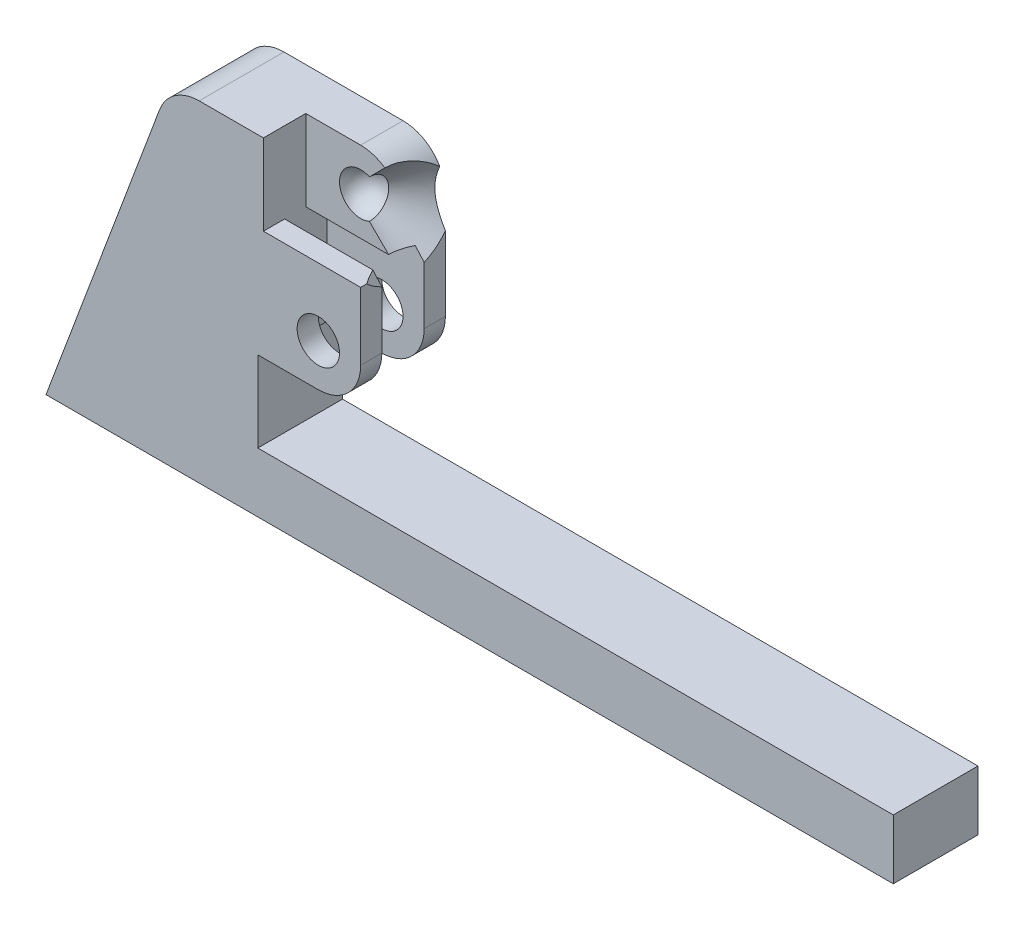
ISO-10303-21;
HEADER;
FILE_DESCRIPTION(('STEP AP214'),'2;1');
FILE_NAME('part.step','',(''),(''),'','','');
FILE_SCHEMA(('AUTOMOTIVE_DESIGN { 1 0 10303 214 1 1 1 1 }'));
ENDSEC;
DATA;
#1=APPLICATION_CONTEXT('core data for automotive mechanical design processes');
#2=APPLICATION_PROTOCOL_DEFINITION('international standard','automotive_design',2000,#1);
#3=PRODUCT_CONTEXT('',#1,'mechanical');
#4=PRODUCT('Part','Part','',(#3));
#5=PRODUCT_RELATED_PRODUCT_CATEGORY('part','',(#4));
#6=PRODUCT_DEFINITION_FORMATION('','',#4);
#7=PRODUCT_DEFINITION_CONTEXT('part definition',#1,'design');
#8=PRODUCT_DEFINITION('design','',#6,#7);
#9=PRODUCT_DEFINITION_SHAPE('','',#8);
#10=(LENGTH_UNIT() NAMED_UNIT(*) SI_UNIT(.MILLI.,.METRE.));
#11=(NAMED_UNIT(*) PLANE_ANGLE_UNIT() SI_UNIT($,.RADIAN.));
#12=(NAMED_UNIT(*) SI_UNIT($,.STERADIAN.) SOLID_ANGLE_UNIT());
#13=UNCERTAINTY_MEASURE_WITH_UNIT(LENGTH_MEASURE(1.E-05),#10,'distance_accuracy_value','');
#14=(GEOMETRIC_REPRESENTATION_CONTEXT(3) GLOBAL_UNCERTAINTY_ASSIGNED_CONTEXT((#13)) GLOBAL_UNIT_ASSIGNED_CONTEXT((#10,
#11,#12)) REPRESENTATION_CONTEXT('',''));
#15=CARTESIAN_POINT('',(0.,0.,0.));
#16=DIRECTION('',(0.,0.,1.));
#17=DIRECTION('',(1.,0.,0.));
#18=AXIS2_PLACEMENT_3D('',#15,#16,#17);
#19=CARTESIAN_POINT('',(10.,25.,10.));
#20=DIRECTION('',(-1.,0.,0.));
#21=DIRECTION('',(0.,-1.,0.));
#22=AXIS2_PLACEMENT_3D('',#19,#20,#21);
#23=PLANE('',#22);
#24=CARTESIAN_POINT('',(10.,25.,0.));
#25=DIRECTION('',(-1.,0.,0.));
#26=DIRECTION('',(0.,-1.,0.));
#27=AXIS2_PLACEMENT_3D('',#24,#25,#26);
#28=CIRCLE('',#27,12.496088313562);
#29=CARTESIAN_POINT('',(10.,13.5478288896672,-5.));
#30=VERTEX_POINT('',#29);
#31=CARTESIAN_POINT('',(10.,17.5065212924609,-10.));
#32=VERTEX_POINT('',#31);
#33=EDGE_CURVE('E239',#30,#32,#28,.F.);
#34=ORIENTED_EDGE('',*,*,#33,.F.);
#35=DIRECTION('',(0.,-1.,0.));
#36=VECTOR('',#35,1.);
#37=CARTESIAN_POINT('',(10.,25.,-5.));
#38=LINE('',#37,#36);
#39=CARTESIAN_POINT('',(10.,0.,-5.));
#40=VERTEX_POINT('',#39);
#41=EDGE_CURVE('E419',#30,#40,#38,.T.);
#42=ORIENTED_EDGE('',*,*,#41,.T.);
#43=DIRECTION('',(0.,0.,-1.));
#44=VECTOR('',#43,1.);
#45=CARTESIAN_POINT('',(10.,0.,10.));
#46=LINE('',#45,#44);
#47=CARTESIAN_POINT('',(10.,0.,-10.));
#48=VERTEX_POINT('',#47);
#49=EDGE_CURVE('E322',#40,#48,#46,.T.);
#50=ORIENTED_EDGE('',*,*,#49,.T.);
#51=DIRECTION('',(0.,1.,0.));
#52=VECTOR('',#51,1.);
#53=CARTESIAN_POINT('',(10.,25.,-10.));
#54=LINE('',#53,#52);
#55=EDGE_CURVE('E386',#48,#32,#54,.T.);
#56=ORIENTED_EDGE('',*,*,#55,.T.);
#57=EDGE_LOOP('',(#34,#42,#50,#56));
#58=FACE_BOUND('',#57,.T.);
#59=ADVANCED_FACE('F33',(#58),#23,.F.);
#60=CARTESIAN_POINT('',(0.,0.,10.));
#61=DIRECTION('',(0.,0.,-1.));
#62=DIRECTION('',(-1.,0.,0.));
#63=AXIS2_PLACEMENT_3D('',#60,#61,#62);
#64=CYLINDRICAL_SURFACE('',#63,10.);
#65=ORIENTED_EDGE('',*,*,#49,.F.);
#66=CARTESIAN_POINT('',(0.,0.,-5.));
#67=DIRECTION('',(0.,0.,-1.));
#68=DIRECTION('',(-1.,0.,0.));
#69=AXIS2_PLACEMENT_3D('',#66,#67,#68);
#70=CIRCLE('',#69,10.);
#71=CARTESIAN_POINT('',(0.,-10.,-5.));
#72=VERTEX_POINT('',#71);
#73=EDGE_CURVE('E460',#40,#72,#70,.T.);
#74=ORIENTED_EDGE('',*,*,#73,.T.);
#75=DIRECTION('',(0.,0.,-1.));
#76=VECTOR('',#75,1.);
#77=CARTESIAN_POINT('',(0.,-10.,10.));
#78=LINE('',#77,#76);
#79=CARTESIAN_POINT('',(0.,-10.,-10.));
#80=VERTEX_POINT('',#79);
#81=EDGE_CURVE('E321',#72,#80,#78,.T.);
#82=ORIENTED_EDGE('',*,*,#81,.T.);
#83=CARTESIAN_POINT('',(0.,0.,-10.));
#84=DIRECTION('',(0.,0.,1.));
#85=DIRECTION('',(1.,0.,0.));
#86=AXIS2_PLACEMENT_3D('',#83,#84,#85);
#87=CIRCLE('',#86,10.);
#88=EDGE_CURVE('E383',#80,#48,#87,.T.);
#89=ORIENTED_EDGE('',*,*,#88,.T.);
#90=EDGE_LOOP('',(#65,#74,#82,#89));
#91=FACE_BOUND('',#90,.T.);
#92=ADVANCED_FACE('F296',(#91),#64,.T.);
#93=CARTESIAN_POINT('',(0.,0.,10.));
#94=DIRECTION('',(0.,0.,-1.));
#95=DIRECTION('',(-1.,0.,0.));
#96=AXIS2_PLACEMENT_3D('',#93,#94,#95);
#97=CYLINDRICAL_SURFACE('',#96,5.);
#98=CARTESIAN_POINT('',(0.,0.,-5.));
#99=DIRECTION('',(0.,0.,-1.));
#100=DIRECTION('',(-1.,0.,0.));
#101=AXIS2_PLACEMENT_3D('',#98,#99,#100);
#102=CIRCLE('',#101,5.);
#103=CARTESIAN_POINT('',(-5.,0.,-5.));
#104=VERTEX_POINT('',#103);
#105=EDGE_CURVE('E455',#104,#104,#102,.T.);
#106=ORIENTED_EDGE('',*,*,#105,.F.);
#107=EDGE_LOOP('',(#106));
#108=FACE_BOUND('',#107,.T.);
#109=CARTESIAN_POINT('',(0.,0.,-10.));
#110=DIRECTION('',(0.,0.,1.));
#111=DIRECTION('',(1.,0.,0.));
#112=AXIS2_PLACEMENT_3D('',#109,#110,#111);
#113=CIRCLE('',#112,5.);
#114=CARTESIAN_POINT('',(5.,0.,-10.));
#115=VERTEX_POINT('',#114);
#116=EDGE_CURVE('E370',#115,#115,#113,.T.);
#117=ORIENTED_EDGE('',*,*,#116,.F.);
#118=EDGE_LOOP('',(#117));
#119=FACE_BOUND('',#118,.T.);
#120=ADVANCED_FACE('F301',(#108,#119),#97,.F.);
#121=CARTESIAN_POINT('',(11.5530314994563,25.,0.));
#122=DIRECTION('',(1.,0.,0.));
#123=DIRECTION('',(0.,0.,-1.));
#124=AXIS2_PLACEMENT_3D('',#121,#122,#123);
#125=CONICAL_SURFACE('',#124,14.0515140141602,0.786168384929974);
#126=DIRECTION('',(-0.706561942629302,0.707651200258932,0.));
#127=VECTOR('',#126,1.);
#128=CARTESIAN_POINT('',(-2.47685361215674,25.,0.));
#129=LINE('',#128,#127);
#130=CARTESIAN_POINT('',(6.58274264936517,15.9264371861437,0.));
#131=VERTEX_POINT('',#130);
#132=CARTESIAN_POINT('',(2.06829768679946,20.4478417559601,0.));
#133=VERTEX_POINT('',#132);
#134=EDGE_CURVE('E53',#131,#133,#129,.T.);
#135=ORIENTED_EDGE('',*,*,#134,.F.);
#136=CARTESIAN_POINT('',(16.1614168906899,15.9264371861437,-16.3134144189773));
#137=CARTESIAN_POINT('',(15.8812075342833,15.9264371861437,-15.9922520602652));
#138=CARTESIAN_POINT('',(15.6020744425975,15.9264371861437,-15.6701440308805));
#139=CARTESIAN_POINT('',(15.0464163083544,15.9264371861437,-15.0236571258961));
#140=CARTESIAN_POINT('',(14.7698914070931,15.9264371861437,-14.6992781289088));
#141=CARTESIAN_POINT('',(14.2194580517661,15.9264371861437,-14.0473388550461));
#142=CARTESIAN_POINT('',(13.9455549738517,15.9264371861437,-13.7197740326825));
#143=CARTESIAN_POINT('',(13.4014895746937,15.9264371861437,-13.0615583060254));
#144=CARTESIAN_POINT('',(13.1313271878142,15.9264371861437,-12.7309074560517));
#145=CARTESIAN_POINT('',(12.5859261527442,15.9264371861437,-12.0540151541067));
#146=CARTESIAN_POINT('',(12.3108531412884,15.9264371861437,-11.7076399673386));
#147=CARTESIAN_POINT('',(11.766748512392,15.9264371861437,-11.0101802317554));
#148=CARTESIAN_POINT('',(11.4977167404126,15.9264371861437,-10.6590958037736));
#149=CARTESIAN_POINT('',(10.9674257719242,15.9264371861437,-9.9514576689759));
#150=CARTESIAN_POINT('',(10.7061613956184,15.9264371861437,-9.59490785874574));
#151=CARTESIAN_POINT('',(10.1933677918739,15.9264371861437,-8.87490734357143));
#152=CARTESIAN_POINT('',(9.94183763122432,15.9264371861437,-8.5114573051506));
#153=CARTESIAN_POINT('',(9.43759082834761,15.9264371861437,-7.75539837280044));
#154=CARTESIAN_POINT('',(9.18560199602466,15.9264371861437,-7.36229870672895));
#155=CARTESIAN_POINT('',(8.82183818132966,15.9264371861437,-6.76385457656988));
#156=CARTESIAN_POINT('',(8.70292087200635,15.9264371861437,-6.56284751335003));
#157=CARTESIAN_POINT('',(8.47068500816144,15.9264371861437,-6.15763206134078));
#158=CARTESIAN_POINT('',(8.35736610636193,15.9264371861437,-5.95342387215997));
#159=CARTESIAN_POINT('',(8.13824172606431,15.9264371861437,-5.54329607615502));
#160=CARTESIAN_POINT('',(8.03237895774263,15.9264371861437,-5.33740729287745));
#161=CARTESIAN_POINT('',(7.82821845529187,15.9264371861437,-4.92192583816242));
#162=CARTESIAN_POINT('',(7.72992122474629,15.9264371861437,-4.71233292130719));
#163=CARTESIAN_POINT('',(7.44847549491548,15.9264371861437,-4.07799518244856));
#164=CARTESIAN_POINT('',(7.2784665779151,15.9264371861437,-3.64713217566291));
#165=CARTESIAN_POINT('',(7.0751310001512,15.9264371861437,-3.03623306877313));
#166=CARTESIAN_POINT('',(7.02151511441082,15.9264371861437,-2.86284164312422));
#167=CARTESIAN_POINT('',(6.92249141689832,15.9264371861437,-2.51371588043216));
#168=CARTESIAN_POINT('',(6.87708315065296,15.9264371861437,-2.33798167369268));
#169=CARTESIAN_POINT('',(6.79526403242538,15.9264371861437,-1.98431336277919));
#170=CARTESIAN_POINT('',(6.75885841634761,15.9264371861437,-1.80637804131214));
#171=CARTESIAN_POINT('',(6.69581922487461,15.9264371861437,-1.44878567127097));
#172=CARTESIAN_POINT('',(6.66918529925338,15.9264371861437,-1.26912868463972));
#173=CARTESIAN_POINT('',(6.62100820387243,15.9264371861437,-0.864106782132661));
#174=CARTESIAN_POINT('',(6.6023382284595,15.9264371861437,-0.63839119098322));
#175=CARTESIAN_POINT('',(6.58184261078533,15.9264371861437,-0.186191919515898));
#176=CARTESIAN_POINT('',(6.58001730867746,15.9264371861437,0.0402917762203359));
#177=CARTESIAN_POINT('',(6.59327695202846,15.9264371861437,0.492548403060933));
#178=CARTESIAN_POINT('',(6.60834583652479,15.9264371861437,0.718321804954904));
#179=CARTESIAN_POINT('',(6.65478204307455,15.9264371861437,1.16818056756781));
#180=CARTESIAN_POINT('',(6.68615139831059,15.9264371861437,1.39226571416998));
#181=CARTESIAN_POINT('',(6.78521292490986,15.9264371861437,1.95834294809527));
#182=CARTESIAN_POINT('',(6.86337475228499,15.9264371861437,2.29852534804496));
#183=CARTESIAN_POINT('',(7.05036960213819,15.9264371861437,2.97034442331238));
#184=CARTESIAN_POINT('',(7.15922191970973,15.9264371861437,3.30197557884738));
#185=CARTESIAN_POINT('',(7.40326135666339,15.9264371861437,3.96017307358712));
#186=CARTESIAN_POINT('',(7.53877022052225,15.9264371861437,4.28661880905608));
#187=CARTESIAN_POINT('',(7.75702230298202,15.9264371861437,4.76931671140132));
#188=CARTESIAN_POINT('',(7.83226197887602,15.9264371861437,4.92903695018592));
#189=CARTESIAN_POINT('',(7.98719131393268,15.9264371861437,5.2463036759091));
#190=CARTESIAN_POINT('',(8.06688087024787,15.9264371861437,5.4038502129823));
#191=CARTESIAN_POINT('',(8.29843282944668,15.9264371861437,5.84770147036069));
#192=CARTESIAN_POINT('',(8.45495448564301,15.9264371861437,6.13157790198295));
#193=CARTESIAN_POINT('',(8.77861301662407,15.9264371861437,6.69324078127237));
#194=CARTESIAN_POINT('',(8.94575210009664,15.9264371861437,6.97102594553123));
#195=CARTESIAN_POINT('',(9.28871574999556,15.9264371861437,7.52146921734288));
#196=CARTESIAN_POINT('',(9.46454711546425,15.9264371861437,7.79412307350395));
#197=CARTESIAN_POINT('',(9.8231623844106,15.9264371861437,8.33477583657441));
#198=CARTESIAN_POINT('',(10.0059458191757,15.9264371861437,8.60277505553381));
#199=CARTESIAN_POINT('',(10.3780210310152,15.9264371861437,9.13589829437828));
#200=CARTESIAN_POINT('',(10.5673371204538,15.9264371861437,9.40100530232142));
#201=CARTESIAN_POINT('',(10.9507534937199,15.9264371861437,9.92773474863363));
#202=CARTESIAN_POINT('',(11.1448538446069,15.9264371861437,10.1893571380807));
#203=CARTESIAN_POINT('',(11.5369699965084,15.9264371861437,10.7094701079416));
#204=CARTESIAN_POINT('',(11.7349840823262,15.9264371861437,10.9679619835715));
#205=CARTESIAN_POINT('',(12.134391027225,15.9264371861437,11.4823244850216));
#206=CARTESIAN_POINT('',(12.3357839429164,15.9264371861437,11.7381950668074));
#207=CARTESIAN_POINT('',(12.9084777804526,15.9264371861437,12.457449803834));
#208=CARTESIAN_POINT('',(13.2831084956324,15.9264371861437,12.9181831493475));
#209=CARTESIAN_POINT('',(14.0396182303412,15.9264371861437,13.8337240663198));
#210=CARTESIAN_POINT('',(14.4214980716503,15.9264371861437,14.2885309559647));
#211=CARTESIAN_POINT('',(15.1872783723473,15.9264371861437,15.1891404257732));
#212=CARTESIAN_POINT('',(15.5711266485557,15.9264371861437,15.6349874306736));
#213=CARTESIAN_POINT('',(16.15014130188,15.9264371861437,16.3008543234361));
#214=CARTESIAN_POINT('',(16.343667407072,15.9264371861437,16.5223044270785));
#215=CARTESIAN_POINT('',(16.7317045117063,15.9264371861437,16.9643373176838));
#216=CARTESIAN_POINT('',(16.9262155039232,15.9264371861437,17.1849201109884));
#217=CARTESIAN_POINT('',(17.1211663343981,15.9264371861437,17.4051137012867));
#218=B_SPLINE_CURVE_WITH_KNOTS('',3,(#136,#137,#138,#139,#140,#141,#142,#143,#144,#145,#146,
#147,#148,#149,#150,#151,#152,#153,#154,#155,#156,#157,#158,#159,#160,#161,#162,#163,#164,#165,
#166,#167,#168,#169,#170,#171,#172,#173,#174,#175,#176,#177,#178,#179,#180,#181,#182,#183,#184,
#185,#186,#187,#188,#189,#190,#191,#192,#193,#194,#195,#196,#197,#198,#199,#200,#201,#202,#203,
#204,#205,#206,#207,#208,#209,#210,#211,#212,#213,#214,#215,#216,#217),.UNSPECIFIED.,.F.,.F.,(4,
2,2,2,2,2,2,2,2,2,2,2,2,2,2,2,2,2,2,2,2,2,2,2,2,2,2,2,2,2,2,2,2,2,2,2,2,2,2,2,4),(0.,
1.27866171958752,2.55739231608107,3.83834301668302,5.11927121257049,6.44615668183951,
7.77300816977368,9.09895402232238,10.4247724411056,11.8251041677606,12.5256788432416,
13.2262100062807,13.9205832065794,14.6150025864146,16.001932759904,16.5462553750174,
17.0905478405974,17.6351561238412,18.1797448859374,18.8585743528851,19.5374175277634,
20.2156158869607,20.893898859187,21.9391975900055,22.9851549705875,24.04461141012,
24.5742225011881,25.1038213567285,26.0760133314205,27.0484082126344,28.0215761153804,
28.994678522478,29.971907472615,30.9491501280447,31.925973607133,32.9028134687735,
34.684167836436,36.4657253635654,38.2306437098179,39.1129297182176,39.9952092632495),.UNSPECIFIED.);
#219=CARTESIAN_POINT('',(7.86719688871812,15.9264371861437,-5.));
#220=VERTEX_POINT('',#219);
#221=EDGE_CURVE('E476',#131,#220,#218,.F.);
#222=ORIENTED_EDGE('',*,*,#221,.T.);
#223=CARTESIAN_POINT('',(17.5868270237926,5.5373843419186,-5.));
#224=CARTESIAN_POINT('',(17.2104439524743,5.92660257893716,-5.));
#225=CARTESIAN_POINT('',(16.8344082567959,6.31615750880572,-5.));
#226=CARTESIAN_POINT('',(16.0832041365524,7.09610703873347,-5.));
#227=CARTESIAN_POINT('',(15.7080357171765,7.48650164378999,-5.));
#228=CARTESIAN_POINT('',(14.9586793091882,8.26835879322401,-5.));
#229=CARTESIAN_POINT('',(14.5844914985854,8.65982150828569,-5.));
#230=CARTESIAN_POINT('',(13.8374031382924,9.44397202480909,-5.));
#231=CARTESIAN_POINT('',(13.4645025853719,9.83665982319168,-5.));
#232=CARTESIAN_POINT('',(12.7170873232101,10.6269563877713,-5.));
#233=CARTESIAN_POINT('',(12.3425865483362,11.0245783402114,-5.));
#234=CARTESIAN_POINT('',(11.5956627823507,11.821768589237,-5.));
#235=CARTESIAN_POINT('',(11.2232397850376,12.2213368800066,-5.));
#236=CARTESIAN_POINT('',(10.4811111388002,13.022959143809,-5.));
#237=CARTESIAN_POINT('',(10.1114053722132,13.4250130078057,-5.));
#238=CARTESIAN_POINT('',(9.37559327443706,14.232397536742,-5.));
#239=CARTESIAN_POINT('',(9.00948688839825,14.6377281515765,-5.));
#240=CARTESIAN_POINT('',(8.38466726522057,15.338019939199,-5.));
#241=CARTESIAN_POINT('',(8.12475280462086,15.6319082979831,-5.));
#242=CARTESIAN_POINT('',(7.60824590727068,16.2225614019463,-5.));
#243=CARTESIAN_POINT('',(7.35165325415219,16.5193259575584,-5.));
#244=CARTESIAN_POINT('',(6.84349515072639,17.115769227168,-5.));
#245=CARTESIAN_POINT('',(6.59191808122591,17.4154380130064,-5.));
#246=CARTESIAN_POINT('',(6.09454980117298,18.0196742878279,-5.));
#247=CARTESIAN_POINT('',(5.84875998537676,18.3242429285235,-5.));
#248=CARTESIAN_POINT('',(5.37964555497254,18.9215854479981,-5.));
#249=CARTESIAN_POINT('',(5.15585279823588,19.2139887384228,-5.));
#250=CARTESIAN_POINT('',(4.82795407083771,19.6582104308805,-5.));
#251=CARTESIAN_POINT('',(4.71998368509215,19.8071755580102,-5.));
#252=CARTESIAN_POINT('',(4.50717212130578,20.1073205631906,-5.));
#253=CARTESIAN_POINT('',(4.4023307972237,20.2585003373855,-5.));
#254=CARTESIAN_POINT('',(4.19599288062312,20.5641229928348,-5.));
#255=CARTESIAN_POINT('',(4.09451340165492,20.7185774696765,-5.));
#256=CARTESIAN_POINT('',(3.89631678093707,21.0304782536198,-5.));
#257=CARTESIAN_POINT('',(3.79959866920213,21.1879239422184,-5.));
#258=CARTESIAN_POINT('',(3.61184996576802,21.5066763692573,-5.));
#259=CARTESIAN_POINT('',(3.52083261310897,21.6679909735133,-5.));
#260=CARTESIAN_POINT('',(3.38987806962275,21.9130114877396,-5.));
#261=CARTESIAN_POINT('',(3.34714066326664,21.9952234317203,-5.));
#262=CARTESIAN_POINT('',(3.26376733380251,22.1607198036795,-5.));
#263=CARTESIAN_POINT('',(3.22313171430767,22.2440043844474,-5.));
#264=CARTESIAN_POINT('',(3.1836687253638,22.3278507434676,-5.));
#265=B_SPLINE_CURVE_WITH_KNOTS('',3,(#223,#224,#225,#226,#227,#228,#229,#230,#231,#232,#233,
#234,#235,#236,#237,#238,#239,#240,#241,#242,#243,#244,#245,#246,#247,#248,#249,#250,#251,#252,
#253,#254,#255,#256,#257,#258,#259,#260,#261,#262,#263,#264),.UNSPECIFIED.,.F.,.F.,(4,2,2,2,2,2,
2,2,2,2,2,2,2,2,2,2,2,2,2,2,4),(0.,1.62431446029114,3.24863861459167,4.87323962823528,
6.49783656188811,8.13648473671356,9.77512801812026,11.4136999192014,13.0522468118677,
14.2292300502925,15.4061362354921,16.5798917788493,17.7539273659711,18.8583906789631,
19.4102959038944,19.9621753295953,20.5165303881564,21.070772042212,21.6262564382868,
21.904200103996,22.1821838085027),.UNSPECIFIED.);
#266=EDGE_CURVE('E11',#30,#220,#265,.T.);
#267=ORIENTED_EDGE('',*,*,#266,.F.);
#268=ORIENTED_EDGE('',*,*,#33,.T.);
#269=CARTESIAN_POINT('',(21.6240766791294,3.03076813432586,-10.));
#270=CARTESIAN_POINT('',(21.1931727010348,3.50499275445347,-10.));
#271=CARTESIAN_POINT('',(20.7635280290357,3.98036867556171,-10.));
#272=CARTESIAN_POINT('',(19.9073895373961,4.93399549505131,-10.));
#273=CARTESIAN_POINT('',(19.4808958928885,5.41224655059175,-10.));
#274=CARTESIAN_POINT('',(18.6306695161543,6.37335320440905,-10.));
#275=CARTESIAN_POINT('',(18.2069464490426,6.85621736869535,-10.));
#276=CARTESIAN_POINT('',(17.5749596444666,7.58362501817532,-10.));
#277=CARTESIAN_POINT('',(17.3649002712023,7.82660897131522,-10.));
#278=CARTESIAN_POINT('',(16.9461212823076,8.31373785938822,-10.));
#279=CARTESIAN_POINT('',(16.7374016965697,8.55788282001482,-10.));
#280=CARTESIAN_POINT('',(16.0694206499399,9.34411392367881,-10.));
#281=CARTESIAN_POINT('',(15.6130814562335,9.88869063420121,-10.));
#282=CARTESIAN_POINT('',(14.7100564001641,10.9857923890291,-10.));
#283=CARTESIAN_POINT('',(14.2633701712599,11.5383171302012,-10.));
#284=CARTESIAN_POINT('',(13.6034123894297,12.374559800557,-10.));
#285=CARTESIAN_POINT('',(13.3852209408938,12.6543957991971,-10.));
#286=CARTESIAN_POINT('',(12.9527058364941,13.2170379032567,-10.));
#287=CARTESIAN_POINT('',(12.7383821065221,13.4998439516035,-10.));
#288=CARTESIAN_POINT('',(12.3143415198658,14.0688351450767,-10.));
#289=CARTESIAN_POINT('',(12.1046240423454,14.3550198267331,-10.));
#290=CARTESIAN_POINT('',(11.6906746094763,14.9313219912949,-10.));
#291=CARTESIAN_POINT('',(11.4864424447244,15.2214393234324,-10.));
#292=CARTESIAN_POINT('',(11.0890564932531,15.7997386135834,-10.));
#293=CARTESIAN_POINT('',(10.8957574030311,16.0878204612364,-10.));
#294=CARTESIAN_POINT('',(10.5168348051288,16.6690120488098,-10.));
#295=CARTESIAN_POINT('',(10.3312114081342,16.9621218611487,-10.));
#296=CARTESIAN_POINT('',(9.96912595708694,17.5545101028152,-10.));
#297=CARTESIAN_POINT('',(9.79267648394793,17.8537962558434,-10.));
#298=CARTESIAN_POINT('',(9.45142194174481,18.4589635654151,-10.));
#299=CARTESIAN_POINT('',(9.28661656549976,18.7648445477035,-10.));
#300=CARTESIAN_POINT('',(8.97565902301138,19.3757704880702,-10.));
#301=CARTESIAN_POINT('',(8.82912698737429,19.6806207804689,-10.));
#302=CARTESIAN_POINT('',(8.55297771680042,20.2980078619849,-10.));
#303=CARTESIAN_POINT('',(8.4233627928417,20.6105456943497,-10.));
#304=CARTESIAN_POINT('',(8.18526896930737,21.2427320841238,-10.));
#305=CARTESIAN_POINT('',(8.07673599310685,21.5623600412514,-10.));
#306=CARTESIAN_POINT('',(7.88477760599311,22.208975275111,-10.));
#307=CARTESIAN_POINT('',(7.80133758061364,22.5359581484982,-10.));
#308=CARTESIAN_POINT('',(7.66521278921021,23.1892739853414,-10.));
#309=CARTESIAN_POINT('',(7.61192507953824,23.5154793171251,-10.));
#310=CARTESIAN_POINT('',(7.5366818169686,24.1715250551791,-10.));
#311=CARTESIAN_POINT('',(7.51472362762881,24.5013651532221,-10.));
#312=CARTESIAN_POINT('',(7.50362415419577,25.1613073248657,-10.));
#313=CARTESIAN_POINT('',(7.51445273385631,25.4914088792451,-10.));
#314=CARTESIAN_POINT('',(7.56811227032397,26.1489999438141,-10.));
#315=CARTESIAN_POINT('',(7.61094928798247,26.4764889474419,-10.));
#316=CARTESIAN_POINT('',(7.7380476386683,27.1945055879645,-10.));
#317=CARTESIAN_POINT('',(7.82912273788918,27.5838170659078,-10.));
#318=CARTESIAN_POINT('',(8.04736221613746,28.3521542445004,-10.));
#319=CARTESIAN_POINT('',(8.1745425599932,28.7311753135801,-10.));
#320=CARTESIAN_POINT('',(8.38809747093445,29.2944439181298,-10.));
#321=CARTESIAN_POINT('',(8.46380006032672,29.4828515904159,-10.));
#322=CARTESIAN_POINT('',(8.62181794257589,29.8568833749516,-10.));
#323=CARTESIAN_POINT('',(8.70413329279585,30.0425074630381,-10.));
#324=CARTESIAN_POINT('',(8.87455925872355,30.4109917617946,-10.));
#325=CARTESIAN_POINT('',(8.96266802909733,30.5938528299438,-10.));
#326=CARTESIAN_POINT('',(9.14400980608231,30.9570018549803,-10.));
#327=CARTESIAN_POINT('',(9.23724267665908,31.1372898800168,-10.));
#328=CARTESIAN_POINT('',(9.51022954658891,31.6492761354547,-10.));
#329=CARTESIAN_POINT('',(9.69552099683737,31.9780273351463,-10.));
#330=CARTESIAN_POINT('',(10.0784459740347,32.628293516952,-10.));
#331=CARTESIAN_POINT('',(10.2760822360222,32.9498068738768,-10.));
#332=CARTESIAN_POINT('',(10.681366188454,33.5868084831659,-10.));
#333=CARTESIAN_POINT('',(10.889021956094,33.9022915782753,-10.));
#334=CARTESIAN_POINT('',(11.3122727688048,34.5278321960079,-10.));
#335=CARTESIAN_POINT('',(11.527867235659,34.837890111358,-10.));
#336=CARTESIAN_POINT('',(11.9664653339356,35.4546737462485,-10.));
#337=CARTESIAN_POINT('',(12.1894963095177,35.7613799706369,-10.));
#338=CARTESIAN_POINT('',(12.6409519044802,36.3707950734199,-10.));
#339=CARTESIAN_POINT('',(12.8693766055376,36.6735038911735,-10.));
#340=CARTESIAN_POINT('',(13.3306083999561,37.2753439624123,-10.));
#341=CARTESIAN_POINT('',(13.563413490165,37.5744767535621,-10.));
#342=CARTESIAN_POINT('',(14.0327956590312,38.1697707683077,-10.));
#343=CARTESIAN_POINT('',(14.2693727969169,38.4659319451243,-10.));
#344=CARTESIAN_POINT('',(14.9329632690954,39.2875168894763,-10.));
#345=CARTESIAN_POINT('',(15.363464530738,39.8101237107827,-10.));
#346=CARTESIAN_POINT('',(16.2322012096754,40.848947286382,-10.));
#347=CARTESIAN_POINT('',(16.6704375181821,41.365163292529,-10.));
#348=CARTESIAN_POINT('',(17.5488802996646,42.3877756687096,-10.));
#349=CARTESIAN_POINT('',(17.9890325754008,42.8942186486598,-10.));
#350=CARTESIAN_POINT('',(18.6527172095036,43.6507589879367,-10.));
#351=CARTESIAN_POINT('',(18.8745003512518,43.9023947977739,-10.));
#352=CARTESIAN_POINT('',(19.3191169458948,44.4047340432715,-10.));
#353=CARTESIAN_POINT('',(19.5419503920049,44.6554374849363,-10.));
#354=CARTESIAN_POINT('',(19.765252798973,44.9057227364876,-10.));
#355=B_SPLINE_CURVE_WITH_KNOTS('',3,(#269,#270,#271,#272,#273,#274,#275,#276,#277,#278,#279,
#280,#281,#282,#283,#284,#285,#286,#287,#288,#289,#290,#291,#292,#293,#294,#295,#296,#297,#298,
#299,#300,#301,#302,#303,#304,#305,#306,#307,#308,#309,#310,#311,#312,#313,#314,#315,#316,#317,
#318,#319,#320,#321,#322,#323,#324,#325,#326,#327,#328,#329,#330,#331,#332,#333,#334,#335,#336,
#337,#338,#339,#340,#341,#342,#343,#344,#345,#346,#347,#348,#349,#350,#351,#352,#353,#354),
.UNSPECIFIED.,.F.,.F.,(4,2,2,2,2,2,2,2,2,2,2,2,2,2,2,2,2,2,2,2,2,2,2,2,2,2,2,2,2,2,2,2,2,2,2,2,
2,2,2,2,2,2,4),(0.,1.92227076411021,3.84464757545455,5.77186846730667,6.73544872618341,
7.69905040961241,9.83046804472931,11.9618046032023,13.026316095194,14.0908071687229,
15.1551538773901,16.2194598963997,17.2601291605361,18.3008134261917,19.3428891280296,
20.3849373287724,21.3992350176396,22.4136711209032,23.4254697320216,24.4366779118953,
25.4268776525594,26.4169940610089,27.4062006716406,28.3955946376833,29.5929206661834,
30.7907769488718,31.3998189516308,32.0088662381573,32.6177204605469,33.2265585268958,
34.3583011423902,35.4902953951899,36.6232179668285,37.7560581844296,38.8936621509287,
40.0312833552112,41.1683963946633,42.3055273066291,44.3366843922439,46.3680770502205,
48.3809884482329,49.3872541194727,50.3935132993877),.UNSPECIFIED.);
#356=CARTESIAN_POINT('',(8.67491929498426,29.9745125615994,-10.));
#357=VERTEX_POINT('',#356);
#358=EDGE_CURVE('E61',#357,#32,#355,.F.);
#359=ORIENTED_EDGE('',*,*,#358,.F.);
#360=CARTESIAN_POINT('',(8.67501999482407,29.9743369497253,-10.0002));
#361=CARTESIAN_POINT('',(8.610960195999,30.0860397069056,-9.87296916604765));
#362=CARTESIAN_POINT('',(8.54612918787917,30.1941178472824,-9.74301652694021));
#363=CARTESIAN_POINT('',(8.4154284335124,30.4033140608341,-9.47820187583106));
#364=CARTESIAN_POINT('',(8.34955904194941,30.504434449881,-9.34334152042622));
#365=CARTESIAN_POINT('',(8.1512994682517,30.7975806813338,-8.93251758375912));
#366=CARTESIAN_POINT('',(8.01804523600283,30.9797547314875,-8.64989181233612));
#367=CARTESIAN_POINT('',(7.75247545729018,31.3202728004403,-8.0692052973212));
#368=CARTESIAN_POINT('',(7.6201633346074,31.478552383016,-7.77110563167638));
#369=CARTESIAN_POINT('',(7.36006743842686,31.772586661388,-7.1619219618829));
#370=CARTESIAN_POINT('',(7.23228587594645,31.9083304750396,-6.85083177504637));
#371=CARTESIAN_POINT('',(6.98028474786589,32.1630189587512,-6.20585071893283));
#372=CARTESIAN_POINT('',(6.85635454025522,32.2811922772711,-5.87154237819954));
#373=CARTESIAN_POINT('',(6.62107084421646,32.4957832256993,-5.19172368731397));
#374=CARTESIAN_POINT('',(6.50971614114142,32.5922029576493,-4.84621442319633));
#375=CARTESIAN_POINT('',(6.30405839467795,32.7638115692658,-4.14546567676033));
#376=CARTESIAN_POINT('',(6.20973337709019,32.839027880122,-3.79023942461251));
#377=CARTESIAN_POINT('',(6.04252904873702,32.9686305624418,-3.07101521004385));
#378=CARTESIAN_POINT('',(5.96964653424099,33.0230200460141,-2.70701856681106));
#379=CARTESIAN_POINT('',(5.85638948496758,33.105989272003,-2.01371573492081));
#380=CARTESIAN_POINT('',(5.81327649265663,33.1367873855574,-1.68512466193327));
#381=CARTESIAN_POINT('',(5.74966030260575,33.1818673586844,-1.02463504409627));
#382=CARTESIAN_POINT('',(5.72915421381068,33.1961513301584,-0.692736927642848));
#383=CARTESIAN_POINT('',(5.71198582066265,33.2081259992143,-0.0284384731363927));
#384=CARTESIAN_POINT('',(5.71529334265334,33.2058376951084,0.303960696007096));
#385=CARTESIAN_POINT('',(5.74547766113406,33.184730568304,0.967159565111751));
#386=CARTESIAN_POINT('',(5.77235568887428,33.1659108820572,1.2979591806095));
#387=CARTESIAN_POINT('',(5.84791630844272,33.1119660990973,1.95398258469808));
#388=CARTESIAN_POINT('',(5.89648897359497,33.0769231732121,2.2792260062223));
#389=CARTESIAN_POINT('',(6.01288216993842,32.990649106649,2.92403985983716));
#390=CARTESIAN_POINT('',(6.08070362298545,32.9394171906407,3.243610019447));
#391=CARTESIAN_POINT('',(6.23281738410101,32.8205701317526,3.87678160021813));
#392=CARTESIAN_POINT('',(6.31716167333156,32.7529031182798,4.19036066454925));
#393=CARTESIAN_POINT('',(6.4990362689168,32.6010888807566,4.80957321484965));
#394=CARTESIAN_POINT('',(6.5965668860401,32.5169412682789,5.11520651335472));
#395=CARTESIAN_POINT('',(6.81750057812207,32.3175874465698,5.76390249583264));
#396=CARTESIAN_POINT('',(6.94257938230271,32.1995995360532,6.10554207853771));
#397=CARTESIAN_POINT('',(7.20202538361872,31.9400665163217,6.7762604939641));
#398=CARTESIAN_POINT('',(7.33639566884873,31.7985135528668,7.10533509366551));
#399=CARTESIAN_POINT('',(7.60989417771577,31.4908965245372,7.74806208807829));
#400=CARTESIAN_POINT('',(7.74900274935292,31.3249260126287,8.06176750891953));
#401=CARTESIAN_POINT('',(8.02850940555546,30.9661321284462,8.67261336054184));
#402=CARTESIAN_POINT('',(8.16890626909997,30.7733321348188,8.96976790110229));
#403=CARTESIAN_POINT('',(8.36989901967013,30.4733157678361,9.38504022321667));
#404=CARTESIAN_POINT('',(8.43162671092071,30.3778390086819,9.51116689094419));
#405=CARTESIAN_POINT('',(8.55413629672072,30.1807525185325,9.75906251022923));
#406=CARTESIAN_POINT('',(8.61491795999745,30.0791413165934,9.88083040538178));
#407=CARTESIAN_POINT('',(8.67501999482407,29.9743369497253,10.0002));
#408=B_SPLINE_CURVE_WITH_KNOTS('',3,(#360,#361,#362,#363,#364,#365,#366,#367,#368,#369,#370,
#371,#372,#373,#374,#375,#376,#377,#378,#379,#380,#381,#382,#383,#384,#385,#386,#387,#388,#389,
#390,#391,#392,#393,#394,#395,#396,#397,#398,#399,#400,#401,#402,#403,#404,#405,#406,#407),
.UNSPECIFIED.,.F.,.F.,(4,2,2,2,2,2,2,2,2,2,2,2,2,2,2,2,2,2,2,2,2,2,2,4),(0.,0.54292284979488,
1.08566410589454,2.16937107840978,3.25595019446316,4.34305248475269,5.46890759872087,
6.59465387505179,7.71893700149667,8.84305206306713,9.84044368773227,10.8377077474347,
11.8337084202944,12.8297611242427,13.820823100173,14.8119325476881,15.806211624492,
16.8005141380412,17.9468602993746,19.0935893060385,20.2360339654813,21.3774892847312,
21.8867608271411,22.3961549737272),.UNSPECIFIED.);
#409=CARTESIAN_POINT('',(5.71590587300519,33.2053896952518,0.));
#410=VERTEX_POINT('',#409);
#411=EDGE_CURVE('E271',#357,#410,#408,.T.);
#412=ORIENTED_EDGE('',*,*,#411,.T.);
#413=DIRECTION('',(0.706561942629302,0.707651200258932,0.));
#414=VECTOR('',#413,1.);
#415=CARTESIAN_POINT('',(-2.47685361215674,25.,0.));
#416=LINE('',#415,#414);
#417=CARTESIAN_POINT('',(2.06829768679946,29.5521582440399,0.));
#418=VERTEX_POINT('',#417);
#419=EDGE_CURVE('E215',#418,#410,#416,.T.);
#420=ORIENTED_EDGE('',*,*,#419,.F.);
#421=CARTESIAN_POINT('',(2.06829768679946,25.,0.));
#422=DIRECTION('',(-1.,0.,0.));
#423=DIRECTION('',(0.,0.,1.));
#424=AXIS2_PLACEMENT_3D('',#421,#422,#423);
#425=CIRCLE('',#424,4.55215824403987);
#426=EDGE_CURVE('E231',#418,#133,#425,.T.);
#427=ORIENTED_EDGE('',*,*,#426,.T.);
#428=EDGE_LOOP('',(#135,#222,#267,#268,#359,#412,#420,#427));
#429=FACE_BOUND('',#428,.T.);
#430=ADVANCED_FACE('F257',(#429),#125,.F.);
#431=CARTESIAN_POINT('',(-28.1081818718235,25.,10.));
#432=DIRECTION('',(0.,0.,-1.));
#433=DIRECTION('',(-1.,0.,0.));
#434=AXIS2_PLACEMENT_3D('',#431,#432,#433);
#435=PLANE('',#434);
#436=CARTESIAN_POINT('',(0.,0.,10.));
#437=DIRECTION('',(0.,0.,1.));
#438=DIRECTION('',(1.,0.,0.));
#439=AXIS2_PLACEMENT_3D('',#436,#437,#438);
#440=CIRCLE('',#439,5.);
#441=CARTESIAN_POINT('',(5.,0.,10.));
#442=VERTEX_POINT('',#441);
#443=EDGE_CURVE('E365',#442,#442,#440,.T.);
#444=ORIENTED_EDGE('',*,*,#443,.F.);
#445=EDGE_LOOP('',(#444));
#446=FACE_BOUND('',#445,.T.);
#447=DIRECTION('',(1.,0.,0.));
#448=VECTOR('',#447,1.);
#449=CARTESIAN_POINT('',(-12.9561916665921,15.9264371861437,10.));
#450=LINE('',#449,#448);
#451=CARTESIAN_POINT('',(-12.9561916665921,15.9264371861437,10.));
#452=VERTEX_POINT('',#451);
#453=CARTESIAN_POINT('',(10.,15.9264371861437,10.));
#454=VERTEX_POINT('',#453);
#455=EDGE_CURVE('E451',#452,#454,#450,.T.);
#456=ORIENTED_EDGE('',*,*,#455,.F.);
#457=DIRECTION('',(0.,-1.,0.));
#458=VECTOR('',#457,1.);
#459=CARTESIAN_POINT('',(-12.9561916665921,15.9264371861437,10.));
#460=LINE('',#459,#458);
#461=CARTESIAN_POINT('',(-12.9561916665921,35.,10.));
#462=VERTEX_POINT('',#461);
#463=EDGE_CURVE('E211',#462,#452,#460,.T.);
#464=ORIENTED_EDGE('',*,*,#463,.F.);
#465=DIRECTION('',(-1.,0.,0.));
#466=VECTOR('',#465,1.);
#467=CARTESIAN_POINT('',(0.,35.,10.));
#468=LINE('',#467,#466);
#469=CARTESIAN_POINT('',(-28.1081818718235,35.,10.));
#470=VERTEX_POINT('',#469);
#471=EDGE_CURVE('E410',#462,#470,#468,.T.);
#472=ORIENTED_EDGE('',*,*,#471,.T.);
#473=CARTESIAN_POINT('',(-28.1081818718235,25.,10.));
#474=DIRECTION('',(0.,0.,1.));
#475=DIRECTION('',(-1.,0.,0.));
#476=AXIS2_PLACEMENT_3D('',#473,#474,#475);
#477=CIRCLE('',#476,10.);
#478=CARTESIAN_POINT('',(-37.4742881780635,28.5037198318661,10.));
#479=VERTEX_POINT('',#478);
#480=EDGE_CURVE('E394',#470,#479,#477,.T.);
#481=ORIENTED_EDGE('',*,*,#480,.T.);
#482=DIRECTION('',(-0.350371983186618,-0.936610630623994,0.));
#483=VECTOR('',#482,1.);
#484=CARTESIAN_POINT('',(-37.4742881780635,28.5037198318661,10.));
#485=LINE('',#484,#483);
#486=CARTESIAN_POINT('',(-64.2769168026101,-43.144779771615,10.));
#487=VERTEX_POINT('',#486);
#488=EDGE_CURVE('E354',#479,#487,#485,.T.);
#489=ORIENTED_EDGE('',*,*,#488,.T.);
#490=DIRECTION('',(1.,0.,0.));
#491=VECTOR('',#490,1.);
#492=CARTESIAN_POINT('',(-64.2769168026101,-43.144779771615,10.));
#493=LINE('',#492,#491);
#494=CARTESIAN_POINT('',(135.72308319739,-43.144779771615,10.));
#495=VERTEX_POINT('',#494);
#496=EDGE_CURVE('E397',#487,#495,#493,.T.);
#497=ORIENTED_EDGE('',*,*,#496,.T.);
#498=DIRECTION('',(0.,1.,0.));
#499=VECTOR('',#498,1.);
#500=CARTESIAN_POINT('',(135.72308319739,-43.144779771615,10.));
#501=LINE('',#500,#499);
#502=CARTESIAN_POINT('',(135.72308319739,-29.0566884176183,10.));
#503=VERTEX_POINT('',#502);
#504=EDGE_CURVE('E399',#495,#503,#501,.T.);
#505=ORIENTED_EDGE('',*,*,#504,.T.);
#506=DIRECTION('',(-1.,0.,0.));
#507=VECTOR('',#506,1.);
#508=CARTESIAN_POINT('',(135.72308319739,-29.0566884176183,10.));
#509=LINE('',#508,#507);
#510=CARTESIAN_POINT('',(-14.2769168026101,-29.0566884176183,10.));
#511=VERTEX_POINT('',#510);
#512=EDGE_CURVE('E401',#503,#511,#509,.T.);
#513=ORIENTED_EDGE('',*,*,#512,.T.);
#514=DIRECTION('',(0.,1.,0.));
#515=VECTOR('',#514,1.);
#516=CARTESIAN_POINT('',(-14.2769168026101,-29.0566884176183,10.));
#517=LINE('',#516,#515);
#518=CARTESIAN_POINT('',(-14.2769168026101,-10.,10.));
#519=VERTEX_POINT('',#518);
#520=EDGE_CURVE('E403',#511,#519,#517,.T.);
#521=ORIENTED_EDGE('',*,*,#520,.T.);
#522=DIRECTION('',(1.,0.,0.));
#523=VECTOR('',#522,1.);
#524=CARTESIAN_POINT('',(0.,-10.,10.));
#525=LINE('',#524,#523);
#526=CARTESIAN_POINT('',(0.,-10.,10.));
#527=VERTEX_POINT('',#526);
#528=EDGE_CURVE('E405',#519,#527,#525,.T.);
#529=ORIENTED_EDGE('',*,*,#528,.T.);
#530=CARTESIAN_POINT('',(0.,0.,10.));
#531=DIRECTION('',(0.,0.,1.));
#532=DIRECTION('',(1.,0.,0.));
#533=AXIS2_PLACEMENT_3D('',#530,#531,#532);
#534=CIRCLE('',#533,10.);
#535=CARTESIAN_POINT('',(10.,0.,10.));
#536=VERTEX_POINT('',#535);
#537=EDGE_CURVE('E407',#527,#536,#534,.T.);
#538=ORIENTED_EDGE('',*,*,#537,.T.);
#539=DIRECTION('',(0.,1.,0.));
#540=VECTOR('',#539,1.);
#541=CARTESIAN_POINT('',(10.,25.,10.));
#542=LINE('',#541,#540);
#543=EDGE_CURVE('E317',#536,#454,#542,.T.);
#544=ORIENTED_EDGE('',*,*,#543,.T.);
#545=EDGE_LOOP('',(#456,#464,#472,#481,#489,#497,#505,#513,#521,#529,#538,#544));
#546=FACE_BOUND('',#545,.T.);
#547=ADVANCED_FACE('F252',(#446,#546),#435,.F.);
#548=CARTESIAN_POINT('',(-28.1081818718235,25.,-10.));
#549=DIRECTION('',(0.,0.,-1.));
#550=DIRECTION('',(-1.,0.,0.));
#551=AXIS2_PLACEMENT_3D('',#548,#549,#550);
#552=PLANE('',#551);
#553=ORIENTED_EDGE('',*,*,#116,.T.);
#554=EDGE_LOOP('',(#553));
#555=FACE_BOUND('',#554,.T.);
#556=CARTESIAN_POINT('',(0.,25.,-10.));
#557=DIRECTION('',(0.,0.,1.));
#558=DIRECTION('',(1.,0.,0.));
#559=AXIS2_PLACEMENT_3D('',#556,#557,#558);
#560=CIRCLE('',#559,10.);
#561=CARTESIAN_POINT('',(0.,35.,-10.));
#562=VERTEX_POINT('',#561);
#563=EDGE_CURVE('E389',#357,#562,#560,.T.);
#564=ORIENTED_EDGE('',*,*,#563,.F.);
#565=ORIENTED_EDGE('',*,*,#358,.T.);
#566=ORIENTED_EDGE('',*,*,#55,.F.);
#567=ORIENTED_EDGE('',*,*,#88,.F.);
#568=DIRECTION('',(1.,0.,0.));
#569=VECTOR('',#568,1.);
#570=CARTESIAN_POINT('',(0.,-10.,-10.));
#571=LINE('',#570,#569);
#572=CARTESIAN_POINT('',(-14.2769168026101,-10.,-10.));
#573=VERTEX_POINT('',#572);
#574=EDGE_CURVE('E380',#573,#80,#571,.T.);
#575=ORIENTED_EDGE('',*,*,#574,.F.);
#576=DIRECTION('',(0.,1.,0.));
#577=VECTOR('',#576,1.);
#578=CARTESIAN_POINT('',(-14.2769168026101,-29.0566884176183,-10.));
#579=LINE('',#578,#577);
#580=CARTESIAN_POINT('',(-14.2769168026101,-29.0566884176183,-10.));
#581=VERTEX_POINT('',#580);
#582=EDGE_CURVE('E378',#581,#573,#579,.T.);
#583=ORIENTED_EDGE('',*,*,#582,.F.);
#584=DIRECTION('',(-1.,0.,0.));
#585=VECTOR('',#584,1.);
#586=CARTESIAN_POINT('',(135.72308319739,-29.0566884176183,-10.));
#587=LINE('',#586,#585);
#588=CARTESIAN_POINT('',(135.72308319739,-29.0566884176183,-10.));
#589=VERTEX_POINT('',#588);
#590=EDGE_CURVE('E376',#589,#581,#587,.T.);
#591=ORIENTED_EDGE('',*,*,#590,.F.);
#592=DIRECTION('',(0.,1.,0.));
#593=VECTOR('',#592,1.);
#594=CARTESIAN_POINT('',(135.72308319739,-43.144779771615,-10.));
#595=LINE('',#594,#593);
#596=CARTESIAN_POINT('',(135.72308319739,-43.144779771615,-10.));
#597=VERTEX_POINT('',#596);
#598=EDGE_CURVE('E374',#597,#589,#595,.T.);
#599=ORIENTED_EDGE('',*,*,#598,.F.);
#600=DIRECTION('',(1.,0.,0.));
#601=VECTOR('',#600,1.);
#602=CARTESIAN_POINT('',(-64.2769168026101,-43.144779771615,-10.));
#603=LINE('',#602,#601);
#604=CARTESIAN_POINT('',(-64.2769168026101,-43.144779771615,-10.));
#605=VERTEX_POINT('',#604);
#606=EDGE_CURVE('E367',#605,#597,#603,.T.);
#607=ORIENTED_EDGE('',*,*,#606,.F.);
#608=DIRECTION('',(-0.350371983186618,-0.936610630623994,0.));
#609=VECTOR('',#608,1.);
#610=CARTESIAN_POINT('',(-37.4742881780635,28.5037198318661,-10.));
#611=LINE('',#610,#609);
#612=CARTESIAN_POINT('',(-37.4742881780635,28.5037198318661,-10.));
#613=VERTEX_POINT('',#612);
#614=EDGE_CURVE('E353',#613,#605,#611,.T.);
#615=ORIENTED_EDGE('',*,*,#614,.F.);
#616=CARTESIAN_POINT('',(-28.1081818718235,25.,-10.));
#617=DIRECTION('',(0.,0.,1.));
#618=DIRECTION('',(-1.,0.,0.));
#619=AXIS2_PLACEMENT_3D('',#616,#617,#618);
#620=CIRCLE('',#619,10.);
#621=CARTESIAN_POINT('',(-28.1081818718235,35.,-10.));
#622=VERTEX_POINT('',#621);
#623=EDGE_CURVE('E360',#622,#613,#620,.T.);
#624=ORIENTED_EDGE('',*,*,#623,.F.);
#625=DIRECTION('',(-1.,0.,0.));
#626=VECTOR('',#625,1.);
#627=CARTESIAN_POINT('',(0.,35.,-10.));
#628=LINE('',#627,#626);
#629=EDGE_CURVE('E392',#562,#622,#628,.T.);
#630=ORIENTED_EDGE('',*,*,#629,.F.);
#631=EDGE_LOOP('',(#564,#565,#566,#567,#575,#583,#591,#599,#607,#615,#624,#630));
#632=FACE_BOUND('',#631,.T.);
#633=ADVANCED_FACE('F246',(#555,#632),#552,.T.);
#634=CARTESIAN_POINT('',(10.,0.,5.));
#635=VERTEX_POINT('',#634);
#636=EDGE_CURVE('E312',#536,#635,#46,.T.);
#637=ORIENTED_EDGE('',*,*,#636,.T.);
#638=DIRECTION('',(0.,1.,0.));
#639=VECTOR('',#638,1.);
#640=CARTESIAN_POINT('',(10.,25.,5.));
#641=LINE('',#640,#639);
#642=CARTESIAN_POINT('',(10.,13.5478288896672,5.));
#643=VERTEX_POINT('',#642);
#644=EDGE_CURVE('E314',#635,#643,#641,.T.);
#645=ORIENTED_EDGE('',*,*,#644,.T.);
#646=CARTESIAN_POINT('',(10.,15.9264371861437,8.59201262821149));
#647=VERTEX_POINT('',#646);
#648=EDGE_CURVE('E240',#647,#643,#28,.F.);
#649=ORIENTED_EDGE('',*,*,#648,.F.);
#650=DIRECTION('',(0.,0.,1.));
#651=VECTOR('',#650,1.);
#652=CARTESIAN_POINT('',(10.,15.9264371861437,10.));
#653=LINE('',#652,#651);
#654=EDGE_CURVE('E228',#647,#454,#653,.T.);
#655=ORIENTED_EDGE('',*,*,#654,.T.);
#656=ORIENTED_EDGE('',*,*,#543,.F.);
#657=EDGE_LOOP('',(#637,#645,#649,#655,#656));
#658=FACE_BOUND('',#657,.T.);
#659=ADVANCED_FACE('F251',(#658),#23,.F.);
#660=CARTESIAN_POINT('',(0.,25.,10.));
#661=DIRECTION('',(0.,0.,-1.));
#662=DIRECTION('',(-1.,0.,0.));
#663=AXIS2_PLACEMENT_3D('',#660,#661,#662);
#664=CYLINDRICAL_SURFACE('',#663,10.);
#665=DIRECTION('',(0.,0.,-1.));
#666=VECTOR('',#665,1.);
#667=CARTESIAN_POINT('',(0.,35.,10.));
#668=LINE('',#667,#666);
#669=CARTESIAN_POINT('',(0.,35.,0.));
#670=VERTEX_POINT('',#669);
#671=EDGE_CURVE('E326',#670,#562,#668,.T.);
#672=ORIENTED_EDGE('',*,*,#671,.F.);
#673=CARTESIAN_POINT('',(0.,25.,0.));
#674=DIRECTION('',(0.,0.,-1.));
#675=DIRECTION('',(-1.,0.,0.));
#676=AXIS2_PLACEMENT_3D('',#673,#674,#675);
#677=CIRCLE('',#676,10.);
#678=EDGE_CURVE('E222',#670,#410,#677,.T.);
#679=ORIENTED_EDGE('',*,*,#678,.T.);
#680=ORIENTED_EDGE('',*,*,#411,.F.);
#681=ORIENTED_EDGE('',*,*,#563,.T.);
#682=EDGE_LOOP('',(#672,#679,#680,#681));
#683=FACE_BOUND('',#682,.T.);
#684=ADVANCED_FACE('F264',(#683),#664,.T.);
#685=CARTESIAN_POINT('',(-28.1081818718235,25.,10.));
#686=DIRECTION('',(0.,0.,-1.));
#687=DIRECTION('',(-1.,0.,0.));
#688=AXIS2_PLACEMENT_3D('',#685,#686,#687);
#689=CYLINDRICAL_SURFACE('',#688,10.);
#690=ORIENTED_EDGE('',*,*,#623,.T.);
#691=DIRECTION('',(0.,0.,-1.));
#692=VECTOR('',#691,1.);
#693=CARTESIAN_POINT('',(-37.4742881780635,28.5037198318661,10.));
#694=LINE('',#693,#692);
#695=EDGE_CURVE('E278',#479,#613,#694,.T.);
#696=ORIENTED_EDGE('',*,*,#695,.F.);
#697=ORIENTED_EDGE('',*,*,#480,.F.);
#698=DIRECTION('',(0.,0.,-1.));
#699=VECTOR('',#698,1.);
#700=CARTESIAN_POINT('',(-28.1081818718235,35.,10.));
#701=LINE('',#700,#699);
#702=EDGE_CURVE('E362',#470,#622,#701,.T.);
#703=ORIENTED_EDGE('',*,*,#702,.T.);
#704=EDGE_LOOP('',(#690,#696,#697,#703));
#705=FACE_BOUND('',#704,.T.);
#706=ADVANCED_FACE('F35',(#705),#689,.T.);
#707=CARTESIAN_POINT('',(-37.4742881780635,28.5037198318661,10.));
#708=DIRECTION('',(0.936610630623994,-0.350371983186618,0.));
#709=DIRECTION('',(0.350371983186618,0.936610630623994,0.));
#710=AXIS2_PLACEMENT_3D('',#707,#708,#709);
#711=PLANE('',#710);
#712=ORIENTED_EDGE('',*,*,#614,.T.);
#713=DIRECTION('',(0.,0.,-1.));
#714=VECTOR('',#713,1.);
#715=CARTESIAN_POINT('',(-64.2769168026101,-43.144779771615,10.));
#716=LINE('',#715,#714);
#717=EDGE_CURVE('E342',#487,#605,#716,.T.);
#718=ORIENTED_EDGE('',*,*,#717,.F.);
#719=ORIENTED_EDGE('',*,*,#488,.F.);
#720=ORIENTED_EDGE('',*,*,#695,.T.);
#721=EDGE_LOOP('',(#712,#718,#719,#720));
#722=FACE_BOUND('',#721,.T.);
#723=ADVANCED_FACE('F352',(#722),#711,.F.);
#724=CARTESIAN_POINT('',(-64.2769168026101,-43.144779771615,10.));
#725=DIRECTION('',(0.,1.,0.));
#726=DIRECTION('',(0.,0.,1.));
#727=AXIS2_PLACEMENT_3D('',#724,#725,#726);
#728=PLANE('',#727);
#729=ORIENTED_EDGE('',*,*,#606,.T.);
#730=DIRECTION('',(0.,0.,-1.));
#731=VECTOR('',#730,1.);
#732=CARTESIAN_POINT('',(135.72308319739,-43.144779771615,10.));
#733=LINE('',#732,#731);
#734=EDGE_CURVE('E340',#495,#597,#733,.T.);
#735=ORIENTED_EDGE('',*,*,#734,.F.);
#736=ORIENTED_EDGE('',*,*,#496,.F.);
#737=ORIENTED_EDGE('',*,*,#717,.T.);
#738=EDGE_LOOP('',(#729,#735,#736,#737));
#739=FACE_BOUND('',#738,.T.);
#740=ADVANCED_FACE('F444',(#739),#728,.F.);
#741=CARTESIAN_POINT('',(135.72308319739,-43.144779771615,10.));
#742=DIRECTION('',(-1.,0.,0.));
#743=DIRECTION('',(0.,0.,1.));
#744=AXIS2_PLACEMENT_3D('',#741,#742,#743);
#745=PLANE('',#744);
#746=ORIENTED_EDGE('',*,*,#598,.T.);
#747=DIRECTION('',(0.,0.,-1.));
#748=VECTOR('',#747,1.);
#749=CARTESIAN_POINT('',(135.72308319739,-29.0566884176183,10.));
#750=LINE('',#749,#748);
#751=EDGE_CURVE('E337',#503,#589,#750,.T.);
#752=ORIENTED_EDGE('',*,*,#751,.F.);
#753=ORIENTED_EDGE('',*,*,#504,.F.);
#754=ORIENTED_EDGE('',*,*,#734,.T.);
#755=EDGE_LOOP('',(#746,#752,#753,#754));
#756=FACE_BOUND('',#755,.T.);
#757=ADVANCED_FACE('F441',(#756),#745,.F.);
#758=CARTESIAN_POINT('',(135.72308319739,-29.0566884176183,10.));
#759=DIRECTION('',(0.,-1.,0.));
#760=DIRECTION('',(1.,0.,0.));
#761=AXIS2_PLACEMENT_3D('',#758,#759,#760);
#762=PLANE('',#761);
#763=ORIENTED_EDGE('',*,*,#590,.T.);
#764=DIRECTION('',(0.,0.,-1.));
#765=VECTOR('',#764,1.);
#766=CARTESIAN_POINT('',(-14.2769168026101,-29.0566884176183,10.));
#767=LINE('',#766,#765);
#768=EDGE_CURVE('E334',#511,#581,#767,.T.);
#769=ORIENTED_EDGE('',*,*,#768,.F.);
#770=ORIENTED_EDGE('',*,*,#512,.F.);
#771=ORIENTED_EDGE('',*,*,#751,.T.);
#772=EDGE_LOOP('',(#763,#769,#770,#771));
#773=FACE_BOUND('',#772,.T.);
#774=ADVANCED_FACE('F437',(#773),#762,.F.);
#775=CARTESIAN_POINT('',(-14.2769168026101,-29.0566884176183,10.));
#776=DIRECTION('',(-1.,0.,0.));
#777=DIRECTION('',(0.,0.,1.));
#778=AXIS2_PLACEMENT_3D('',#775,#776,#777);
#779=PLANE('',#778);
#780=ORIENTED_EDGE('',*,*,#582,.T.);
#781=DIRECTION('',(0.,0.,-1.));
#782=VECTOR('',#781,1.);
#783=CARTESIAN_POINT('',(-14.2769168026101,-10.,10.));
#784=LINE('',#783,#782);
#785=EDGE_CURVE('E331',#519,#573,#784,.T.);
#786=ORIENTED_EDGE('',*,*,#785,.F.);
#787=ORIENTED_EDGE('',*,*,#520,.F.);
#788=ORIENTED_EDGE('',*,*,#768,.T.);
#789=EDGE_LOOP('',(#780,#786,#787,#788));
#790=FACE_BOUND('',#789,.T.);
#791=ADVANCED_FACE('F433',(#790),#779,.F.);
#792=CARTESIAN_POINT('',(0.,-10.,10.));
#793=DIRECTION('',(0.,1.,0.));
#794=DIRECTION('',(-1.,0.,0.));
#795=AXIS2_PLACEMENT_3D('',#792,#793,#794);
#796=PLANE('',#795);
#797=ORIENTED_EDGE('',*,*,#81,.F.);
#798=DIRECTION('',(-1.,0.,0.));
#799=VECTOR('',#798,1.);
#800=CARTESIAN_POINT('',(0.,-10.,-5.));
#801=LINE('',#800,#799);
#802=CARTESIAN_POINT('',(-12.9561916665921,-10.,-5.));
#803=VERTEX_POINT('',#802);
#804=EDGE_CURVE('E458',#72,#803,#801,.T.);
#805=ORIENTED_EDGE('',*,*,#804,.T.);
#806=DIRECTION('',(0.,0.,1.));
#807=VECTOR('',#806,1.);
#808=CARTESIAN_POINT('',(-12.9561916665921,-10.,10.));
#809=LINE('',#808,#807);
#810=CARTESIAN_POINT('',(-12.9561916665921,-10.,5.));
#811=VERTEX_POINT('',#810);
#812=EDGE_CURVE('E197',#803,#811,#809,.T.);
#813=ORIENTED_EDGE('',*,*,#812,.T.);
#814=DIRECTION('',(1.,0.,0.));
#815=VECTOR('',#814,1.);
#816=CARTESIAN_POINT('',(0.,-10.,5.));
#817=LINE('',#816,#815);
#818=CARTESIAN_POINT('',(0.,-10.,5.));
#819=VERTEX_POINT('',#818);
#820=EDGE_CURVE('E193',#811,#819,#817,.T.);
#821=ORIENTED_EDGE('',*,*,#820,.T.);
#822=EDGE_CURVE('E324',#527,#819,#78,.T.);
#823=ORIENTED_EDGE('',*,*,#822,.F.);
#824=ORIENTED_EDGE('',*,*,#528,.F.);
#825=ORIENTED_EDGE('',*,*,#785,.T.);
#826=ORIENTED_EDGE('',*,*,#574,.T.);
#827=EDGE_LOOP('',(#797,#805,#813,#821,#823,#824,#825,#826));
#828=FACE_BOUND('',#827,.T.);
#829=ADVANCED_FACE('F426',(#828),#796,.F.);
#830=ORIENTED_EDGE('',*,*,#822,.T.);
#831=CARTESIAN_POINT('',(0.,0.,5.));
#832=DIRECTION('',(0.,0.,1.));
#833=DIRECTION('',(1.,0.,0.));
#834=AXIS2_PLACEMENT_3D('',#831,#832,#833);
#835=CIRCLE('',#834,10.);
#836=EDGE_CURVE('E467',#819,#635,#835,.T.);
#837=ORIENTED_EDGE('',*,*,#836,.T.);
#838=ORIENTED_EDGE('',*,*,#636,.F.);
#839=ORIENTED_EDGE('',*,*,#537,.F.);
#840=EDGE_LOOP('',(#830,#837,#838,#839));
#841=FACE_BOUND('',#840,.T.);
#842=ADVANCED_FACE('F262',(#841),#64,.T.);
#843=CARTESIAN_POINT('',(0.,35.,10.));
#844=DIRECTION('',(0.,-1.,0.));
#845=DIRECTION('',(0.,0.,-1.));
#846=AXIS2_PLACEMENT_3D('',#843,#844,#845);
#847=PLANE('',#846);
#848=ORIENTED_EDGE('',*,*,#471,.F.);
#849=DIRECTION('',(0.,0.,-1.));
#850=VECTOR('',#849,1.);
#851=CARTESIAN_POINT('',(-12.9561916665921,35.,10.));
#852=LINE('',#851,#850);
#853=CARTESIAN_POINT('',(-12.9561916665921,35.,0.));
#854=VERTEX_POINT('',#853);
#855=EDGE_CURVE('E46',#462,#854,#852,.T.);
#856=ORIENTED_EDGE('',*,*,#855,.T.);
#857=DIRECTION('',(1.,0.,0.));
#858=VECTOR('',#857,1.);
#859=CARTESIAN_POINT('',(0.,35.,0.));
#860=LINE('',#859,#858);
#861=EDGE_CURVE('E225',#854,#670,#860,.T.);
#862=ORIENTED_EDGE('',*,*,#861,.T.);
#863=ORIENTED_EDGE('',*,*,#671,.T.);
#864=ORIENTED_EDGE('',*,*,#629,.T.);
#865=ORIENTED_EDGE('',*,*,#702,.F.);
#866=EDGE_LOOP('',(#848,#856,#862,#863,#864,#865));
#867=FACE_BOUND('',#866,.T.);
#868=ADVANCED_FACE('F259',(#867),#847,.F.);
#869=CARTESIAN_POINT('',(0.,0.,5.));
#870=DIRECTION('',(0.,0.,1.));
#871=DIRECTION('',(1.,0.,0.));
#872=AXIS2_PLACEMENT_3D('',#869,#870,#871);
#873=CIRCLE('',#872,5.);
#874=CARTESIAN_POINT('',(5.,0.,5.));
#875=VERTEX_POINT('',#874);
#876=EDGE_CURVE('E463',#875,#875,#873,.T.);
#877=ORIENTED_EDGE('',*,*,#876,.F.);
#878=EDGE_LOOP('',(#877));
#879=FACE_BOUND('',#878,.T.);
#880=ORIENTED_EDGE('',*,*,#443,.T.);
#881=EDGE_LOOP('',(#880));
#882=FACE_BOUND('',#881,.T.);
#883=ADVANCED_FACE('F254',(#879,#882),#97,.F.);
#884=CARTESIAN_POINT('',(17.5868270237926,5.5373843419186,5.));
#885=CARTESIAN_POINT('',(17.2104439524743,5.92660257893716,5.));
#886=CARTESIAN_POINT('',(16.8344082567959,6.31615750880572,5.));
#887=CARTESIAN_POINT('',(16.0832041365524,7.09610703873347,5.));
#888=CARTESIAN_POINT('',(15.7080357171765,7.48650164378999,5.));
#889=CARTESIAN_POINT('',(14.9586793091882,8.26835879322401,5.));
#890=CARTESIAN_POINT('',(14.5844914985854,8.65982150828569,5.));
#891=CARTESIAN_POINT('',(13.8374031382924,9.44397202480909,5.));
#892=CARTESIAN_POINT('',(13.4645025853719,9.83665982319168,5.));
#893=CARTESIAN_POINT('',(12.7170873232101,10.6269563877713,5.));
#894=CARTESIAN_POINT('',(12.3425865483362,11.0245783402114,5.));
#895=CARTESIAN_POINT('',(11.5956627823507,11.821768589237,5.));
#896=CARTESIAN_POINT('',(11.2232397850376,12.2213368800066,5.));
#897=CARTESIAN_POINT('',(10.4811111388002,13.022959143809,5.));
#898=CARTESIAN_POINT('',(10.1114053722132,13.4250130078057,5.));
#899=CARTESIAN_POINT('',(9.37559327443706,14.232397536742,5.));
#900=CARTESIAN_POINT('',(9.00948688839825,14.6377281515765,5.));
#901=CARTESIAN_POINT('',(8.38466726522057,15.338019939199,5.));
#902=CARTESIAN_POINT('',(8.12475280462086,15.6319082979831,5.));
#903=CARTESIAN_POINT('',(7.60824590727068,16.2225614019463,5.));
#904=CARTESIAN_POINT('',(7.35165325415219,16.5193259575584,5.));
#905=CARTESIAN_POINT('',(6.84349515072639,17.115769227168,5.));
#906=CARTESIAN_POINT('',(6.59191808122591,17.4154380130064,5.));
#907=CARTESIAN_POINT('',(6.09454980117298,18.0196742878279,5.));
#908=CARTESIAN_POINT('',(5.84875998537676,18.3242429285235,5.));
#909=CARTESIAN_POINT('',(5.37964555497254,18.9215854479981,5.));
#910=CARTESIAN_POINT('',(5.15585279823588,19.2139887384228,5.));
#911=CARTESIAN_POINT('',(4.82795407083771,19.6582104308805,5.));
#912=CARTESIAN_POINT('',(4.71998368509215,19.8071755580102,5.));
#913=CARTESIAN_POINT('',(4.50717212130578,20.1073205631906,5.));
#914=CARTESIAN_POINT('',(4.4023307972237,20.2585003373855,5.));
#915=CARTESIAN_POINT('',(4.19599288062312,20.5641229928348,5.));
#916=CARTESIAN_POINT('',(4.09451340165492,20.7185774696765,5.));
#917=CARTESIAN_POINT('',(3.89631678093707,21.0304782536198,5.));
#918=CARTESIAN_POINT('',(3.79959866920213,21.1879239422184,5.));
#919=CARTESIAN_POINT('',(3.61184996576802,21.5066763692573,5.));
#920=CARTESIAN_POINT('',(3.52083261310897,21.6679909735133,5.));
#921=CARTESIAN_POINT('',(3.38987806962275,21.9130114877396,5.));
#922=CARTESIAN_POINT('',(3.34714066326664,21.9952234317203,5.));
#923=CARTESIAN_POINT('',(3.26376733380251,22.1607198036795,5.));
#924=CARTESIAN_POINT('',(3.22313171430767,22.2440043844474,5.));
#925=CARTESIAN_POINT('',(3.1836687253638,22.3278507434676,5.));
#926=B_SPLINE_CURVE_WITH_KNOTS('',3,(#884,#885,#886,#887,#888,#889,#890,#891,#892,#893,#894,
#895,#896,#897,#898,#899,#900,#901,#902,#903,#904,#905,#906,#907,#908,#909,#910,#911,#912,#913,
#914,#915,#916,#917,#918,#919,#920,#921,#922,#923,#924,#925),.UNSPECIFIED.,.F.,.F.,(4,2,2,2,2,2,
2,2,2,2,2,2,2,2,2,2,2,2,2,2,4),(0.,1.62431446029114,3.24863861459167,4.87323962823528,
6.49783656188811,8.13648473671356,9.77512801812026,11.4136999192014,13.0522468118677,
14.2292300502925,15.4061362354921,16.5798917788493,17.7539273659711,18.8583906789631,
19.4102959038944,19.9621753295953,20.5165303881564,21.070772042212,21.6262564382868,
21.904200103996,22.1821838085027),.UNSPECIFIED.);
#927=CARTESIAN_POINT('',(7.86719688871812,15.9264371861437,5.));
#928=VERTEX_POINT('',#927);
#929=EDGE_CURVE('E470',#928,#643,#926,.F.);
#930=ORIENTED_EDGE('',*,*,#929,.F.);
#931=CARTESIAN_POINT('',(16.1614168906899,15.9264371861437,16.3134144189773));
#932=CARTESIAN_POINT('',(15.8810833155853,15.9264371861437,15.9921096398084));
#933=CARTESIAN_POINT('',(15.6018269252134,15.9264371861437,15.6698583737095));
#934=CARTESIAN_POINT('',(15.045924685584,15.9264371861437,15.023082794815));
#935=CARTESIAN_POINT('',(14.7692789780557,15.9264371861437,14.6985583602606));
#936=CARTESIAN_POINT('',(14.218606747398,15.9264371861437,14.0463249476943));
#937=CARTESIAN_POINT('',(13.9445856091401,15.9264371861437,13.7186114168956));
#938=CARTESIAN_POINT('',(13.4002883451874,15.9264371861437,13.0600948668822));
#939=CARTESIAN_POINT('',(13.130012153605,15.9264371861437,12.7292919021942));
#940=CARTESIAN_POINT('',(12.5846273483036,15.9264371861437,12.0523860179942));
#941=CARTESIAN_POINT('',(12.3096803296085,15.9264371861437,11.7061526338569));
#942=CARTESIAN_POINT('',(11.7658242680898,15.9264371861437,11.0089793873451));
#943=CARTESIAN_POINT('',(11.4969150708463,15.9264371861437,10.6580396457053));
#944=CARTESIAN_POINT('',(10.9668643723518,15.9264371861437,9.9506948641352));
#945=CARTESIAN_POINT('',(10.7057176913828,15.9264371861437,9.59429372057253));
#946=CARTESIAN_POINT('',(10.1931522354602,15.9264371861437,8.8745958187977));
#947=CARTESIAN_POINT('',(9.94173252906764,15.9264371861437,8.51129972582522));
#948=CARTESIAN_POINT('',(9.43767140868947,15.9264371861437,7.75551918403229));
#949=CARTESIAN_POINT('',(9.18575883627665,15.9264371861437,7.36254327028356));
#950=CARTESIAN_POINT('',(8.82209908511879,15.9264371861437,6.76429049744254));
#951=CARTESIAN_POINT('',(8.70321468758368,15.9264371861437,6.56334807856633));
#952=CARTESIAN_POINT('',(8.47104035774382,15.9264371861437,6.15826417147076));
#953=CARTESIAN_POINT('',(8.3577500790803,15.9264371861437,5.95412288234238));
#954=CARTESIAN_POINT('',(8.13860927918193,15.9264371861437,5.54400343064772));
#955=CARTESIAN_POINT('',(8.0327055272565,15.9264371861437,5.33805391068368));
#956=CARTESIAN_POINT('',(7.82846666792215,15.9264371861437,4.92244889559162));
#957=CARTESIAN_POINT('',(7.73013206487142,15.9264371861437,4.71279315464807));
#958=CARTESIAN_POINT('',(7.44858161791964,15.9264371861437,4.07826424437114));
#959=CARTESIAN_POINT('',(7.27851217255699,15.9264371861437,3.64726918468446));
#960=CARTESIAN_POINT('',(7.07509023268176,15.9264371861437,3.03611057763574));
#961=CARTESIAN_POINT('',(7.02143882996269,15.9264371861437,2.8625949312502));
#962=CARTESIAN_POINT('',(6.92235615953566,15.9264371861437,2.51321671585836));
#963=CARTESIAN_POINT('',(6.87692447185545,15.9264371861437,2.33735426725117));
#964=CARTESIAN_POINT('',(6.79513098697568,15.9264371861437,1.98367959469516));
#965=CARTESIAN_POINT('',(6.75876153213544,15.9264371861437,1.80586915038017));
#966=CARTESIAN_POINT('',(6.69578122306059,15.9264371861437,1.44852932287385));
#967=CARTESIAN_POINT('',(6.66917001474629,15.9264371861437,1.26900000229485));
#968=CARTESIAN_POINT('',(6.62107685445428,15.9264371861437,0.864684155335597));
#969=CARTESIAN_POINT('',(6.60243411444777,15.9264371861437,0.639551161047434));
#970=CARTESIAN_POINT('',(6.58190441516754,15.9264371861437,0.188503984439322));
#971=CARTESIAN_POINT('',(6.58001883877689,15.9264371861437,-0.0374102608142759));
#972=CARTESIAN_POINT('',(6.59310851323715,15.9264371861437,-0.489704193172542));
#973=CARTESIAN_POINT('',(6.60815488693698,15.9264371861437,-0.716081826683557));
#974=CARTESIAN_POINT('',(6.65462963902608,15.9264371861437,-1.16709184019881));
#975=CARTESIAN_POINT('',(6.68605640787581,15.9264371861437,-1.39172438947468));
#976=CARTESIAN_POINT('',(6.78581382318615,15.9264371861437,-1.9617744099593));
#977=CARTESIAN_POINT('',(6.86494113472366,15.9264371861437,-2.30532625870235));
#978=CARTESIAN_POINT('',(7.05451537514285,15.9264371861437,-2.98402483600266));
#979=CARTESIAN_POINT('',(7.16501247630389,15.9264371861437,-3.319157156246));
#980=CARTESIAN_POINT('',(7.41037188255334,15.9264371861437,-3.97769631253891));
#981=CARTESIAN_POINT('',(7.54506481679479,15.9264371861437,-4.30116699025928));
#982=CARTESIAN_POINT('',(7.76154958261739,15.9264371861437,-4.77900005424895));
#983=CARTESIAN_POINT('',(7.83597243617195,15.9264371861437,-4.93677259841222));
#984=CARTESIAN_POINT('',(7.98913989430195,15.9264371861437,-5.25015170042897));
#985=CARTESIAN_POINT('',(8.06788323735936,15.9264371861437,-5.40575887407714));
#986=CARTESIAN_POINT('',(8.14853648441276,15.9264371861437,-5.56037208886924));
#987=B_SPLINE_CURVE_WITH_KNOTS('',3,(#931,#932,#933,#934,#935,#936,#937,#938,#939,#940,#941,
#942,#943,#944,#945,#946,#947,#948,#949,#950,#951,#952,#953,#954,#955,#956,#957,#958,#959,#960,
#961,#962,#963,#964,#965,#966,#967,#968,#969,#970,#971,#972,#973,#974,#975,#976,#977,#978,#979,
#980,#981,#982,#983,#984,#985,#986),.UNSPECIFIED.,.F.,.F.,(4,2,2,2,2,2,2,2,2,2,2,2,2,2,2,2,2,2,
2,2,2,2,2,2,2,2,2,4),(0.,1.27922867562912,2.55852640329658,3.84004650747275,5.12154403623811,
6.44786134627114,7.77414469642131,9.09952222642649,10.4247725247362,11.8246687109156,
12.5250262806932,13.2253404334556,13.9199317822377,14.6145693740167,16.0019324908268,
16.546642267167,17.0913242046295,17.6355443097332,18.1797446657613,18.8568304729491,
19.5339721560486,20.2139688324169,20.8938987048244,21.9496434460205,23.0070863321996,
24.0573967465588,24.5806788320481,25.10380893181),.UNSPECIFIED.);
#988=EDGE_CURVE('E206',#647,#928,#987,.T.);
#989=ORIENTED_EDGE('',*,*,#988,.F.);
#990=ORIENTED_EDGE('',*,*,#648,.T.);
#991=EDGE_LOOP('',(#930,#989,#990));
#992=FACE_BOUND('',#991,.T.);
#993=ADVANCED_FACE('F242',(#992),#125,.F.);
#994=CARTESIAN_POINT('',(0.,25.,0.));
#995=DIRECTION('',(-1.,0.,0.));
#996=DIRECTION('',(0.,1.,0.));
#997=AXIS2_PLACEMENT_3D('',#994,#995,#996);
#998=SPHERICAL_SURFACE('',#997,5.);
#999=CARTESIAN_POINT('',(0.,25.,0.));
#1000=DIRECTION('',(0.,0.,-1.));
#1001=DIRECTION('',(-1.,0.,0.));
#1002=AXIS2_PLACEMENT_3D('',#999,#1000,#1001);
#1003=CIRCLE('',#1002,5.);
#1004=EDGE_CURVE('E277',#133,#418,#1003,.T.);
#1005=ORIENTED_EDGE('',*,*,#1004,.F.);
#1006=ORIENTED_EDGE('',*,*,#426,.F.);
#1007=EDGE_LOOP('',(#1005,#1006));
#1008=FACE_BOUND('',#1007,.T.);
#1009=ADVANCED_FACE('F290',(#1008),#998,.F.);
#1010=CARTESIAN_POINT('',(-12.9561916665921,15.9264371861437,0.));
#1011=DIRECTION('',(-1.,0.,0.));
#1012=DIRECTION('',(0.,0.,1.));
#1013=AXIS2_PLACEMENT_3D('',#1010,#1011,#1012);
#1014=PLANE('',#1013);
#1015=ORIENTED_EDGE('',*,*,#463,.T.);
#1016=DIRECTION('',(0.,0.,1.));
#1017=VECTOR('',#1016,1.);
#1018=CARTESIAN_POINT('',(-12.9561916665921,15.9264371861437,0.));
#1019=LINE('',#1018,#1017);
#1020=CARTESIAN_POINT('',(-12.9561916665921,15.9264371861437,5.));
#1021=VERTEX_POINT('',#1020);
#1022=EDGE_CURVE('E203',#1021,#452,#1019,.T.);
#1023=ORIENTED_EDGE('',*,*,#1022,.F.);
#1024=DIRECTION('',(0.,1.,0.));
#1025=VECTOR('',#1024,1.);
#1026=CARTESIAN_POINT('',(-12.9561916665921,-58.5240681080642,5.));
#1027=LINE('',#1026,#1025);
#1028=EDGE_CURVE('E187',#811,#1021,#1027,.T.);
#1029=ORIENTED_EDGE('',*,*,#1028,.F.);
#1030=ORIENTED_EDGE('',*,*,#812,.F.);
#1031=DIRECTION('',(0.,1.,0.));
#1032=VECTOR('',#1031,1.);
#1033=CARTESIAN_POINT('',(-12.9561916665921,-58.5240681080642,-5.));
#1034=LINE('',#1033,#1032);
#1035=CARTESIAN_POINT('',(-12.9561916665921,15.9264371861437,-5.));
#1036=VERTEX_POINT('',#1035);
#1037=EDGE_CURVE('E198',#803,#1036,#1034,.T.);
#1038=ORIENTED_EDGE('',*,*,#1037,.T.);
#1039=DIRECTION('',(0.,0.,1.));
#1040=VECTOR('',#1039,1.);
#1041=CARTESIAN_POINT('',(-12.9561916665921,15.9264371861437,-5.));
#1042=LINE('',#1041,#1040);
#1043=CARTESIAN_POINT('',(-12.9561916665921,15.9264371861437,0.));
#1044=VERTEX_POINT('',#1043);
#1045=EDGE_CURVE('E207',#1036,#1044,#1042,.T.);
#1046=ORIENTED_EDGE('',*,*,#1045,.T.);
#1047=DIRECTION('',(0.,-1.,0.));
#1048=VECTOR('',#1047,1.);
#1049=CARTESIAN_POINT('',(-12.9561916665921,15.9264371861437,0.));
#1050=LINE('',#1049,#1048);
#1051=EDGE_CURVE('E217',#854,#1044,#1050,.T.);
#1052=ORIENTED_EDGE('',*,*,#1051,.F.);
#1053=ORIENTED_EDGE('',*,*,#855,.F.);
#1054=EDGE_LOOP('',(#1015,#1023,#1029,#1030,#1038,#1046,#1052,#1053));
#1055=FACE_BOUND('',#1054,.T.);
#1056=ADVANCED_FACE('F209',(#1055),#1014,.F.);
#1057=CARTESIAN_POINT('',(-12.9561916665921,15.9264371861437,0.));
#1058=DIRECTION('',(0.,-1.,0.));
#1059=DIRECTION('',(0.,0.,-1.));
#1060=AXIS2_PLACEMENT_3D('',#1057,#1058,#1059);
#1061=PLANE('',#1060);
#1062=ORIENTED_EDGE('',*,*,#988,.T.);
#1063=DIRECTION('',(1.,0.,0.));
#1064=VECTOR('',#1063,1.);
#1065=CARTESIAN_POINT('',(14.7625107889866,15.9264371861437,5.));
#1066=LINE('',#1065,#1064);
#1067=EDGE_CURVE('E190',#1021,#928,#1066,.T.);
#1068=ORIENTED_EDGE('',*,*,#1067,.F.);
#1069=ORIENTED_EDGE('',*,*,#1022,.T.);
#1070=ORIENTED_EDGE('',*,*,#455,.T.);
#1071=ORIENTED_EDGE('',*,*,#654,.F.);
#1072=EDGE_LOOP('',(#1062,#1068,#1069,#1070,#1071));
#1073=FACE_BOUND('',#1072,.T.);
#1074=ADVANCED_FACE('F202',(#1073),#1061,.F.);
#1075=CARTESIAN_POINT('',(-12.9561916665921,46.4141595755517,0.));
#1076=DIRECTION('',(0.,0.,-1.));
#1077=DIRECTION('',(-1.,0.,0.));
#1078=AXIS2_PLACEMENT_3D('',#1075,#1076,#1077);
#1079=PLANE('',#1078);
#1080=ORIENTED_EDGE('',*,*,#1051,.T.);
#1081=DIRECTION('',(1.,0.,0.));
#1082=VECTOR('',#1081,1.);
#1083=CARTESIAN_POINT('',(-12.9561916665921,15.9264371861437,0.));
#1084=LINE('',#1083,#1082);
#1085=EDGE_CURVE('E213',#1044,#131,#1084,.T.);
#1086=ORIENTED_EDGE('',*,*,#1085,.T.);
#1087=ORIENTED_EDGE('',*,*,#134,.T.);
#1088=ORIENTED_EDGE('',*,*,#1004,.T.);
#1089=ORIENTED_EDGE('',*,*,#419,.T.);
#1090=ORIENTED_EDGE('',*,*,#678,.F.);
#1091=ORIENTED_EDGE('',*,*,#861,.F.);
#1092=EDGE_LOOP('',(#1080,#1086,#1087,#1088,#1089,#1090,#1091));
#1093=FACE_BOUND('',#1092,.T.);
#1094=ADVANCED_FACE('F288',(#1093),#1079,.F.);
#1095=CARTESIAN_POINT('',(14.7625107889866,-58.5240681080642,-5.));
#1096=DIRECTION('',(0.,0.,-1.));
#1097=DIRECTION('',(-1.,0.,0.));
#1098=AXIS2_PLACEMENT_3D('',#1095,#1096,#1097);
#1099=PLANE('',#1098);
#1100=ORIENTED_EDGE('',*,*,#105,.T.);
#1101=EDGE_LOOP('',(#1100));
#1102=FACE_BOUND('',#1101,.T.);
#1103=ORIENTED_EDGE('',*,*,#73,.F.);
#1104=ORIENTED_EDGE('',*,*,#41,.F.);
#1105=ORIENTED_EDGE('',*,*,#266,.T.);
#1106=DIRECTION('',(-1.,0.,0.));
#1107=VECTOR('',#1106,1.);
#1108=CARTESIAN_POINT('',(14.7625107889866,15.9264371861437,-5.));
#1109=LINE('',#1108,#1107);
#1110=EDGE_CURVE('E501',#220,#1036,#1109,.T.);
#1111=ORIENTED_EDGE('',*,*,#1110,.T.);
#1112=ORIENTED_EDGE('',*,*,#1037,.F.);
#1113=ORIENTED_EDGE('',*,*,#804,.F.);
#1114=EDGE_LOOP('',(#1103,#1104,#1105,#1111,#1112,#1113));
#1115=FACE_BOUND('',#1114,.T.);
#1116=ADVANCED_FACE('F485',(#1102,#1115),#1099,.F.);
#1117=CARTESIAN_POINT('',(14.7625107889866,-58.5240681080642,5.));
#1118=DIRECTION('',(0.,0.,1.));
#1119=DIRECTION('',(1.,0.,0.));
#1120=AXIS2_PLACEMENT_3D('',#1117,#1118,#1119);
#1121=PLANE('',#1120);
#1122=ORIENTED_EDGE('',*,*,#876,.T.);
#1123=EDGE_LOOP('',(#1122));
#1124=FACE_BOUND('',#1123,.T.);
#1125=ORIENTED_EDGE('',*,*,#1028,.T.);
#1126=ORIENTED_EDGE('',*,*,#1067,.T.);
#1127=ORIENTED_EDGE('',*,*,#929,.T.);
#1128=ORIENTED_EDGE('',*,*,#644,.F.);
#1129=ORIENTED_EDGE('',*,*,#836,.F.);
#1130=ORIENTED_EDGE('',*,*,#820,.F.);
#1131=EDGE_LOOP('',(#1125,#1126,#1127,#1128,#1129,#1130));
#1132=FACE_BOUND('',#1131,.T.);
#1133=ADVANCED_FACE('F189',(#1124,#1132),#1121,.F.);
#1134=CARTESIAN_POINT('',(14.7625107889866,15.9264371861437,5.));
#1135=DIRECTION('',(0.,-1.,0.));
#1136=DIRECTION('',(0.,0.,-1.));
#1137=AXIS2_PLACEMENT_3D('',#1134,#1135,#1136);
#1138=PLANE('',#1137);
#1139=ORIENTED_EDGE('',*,*,#1085,.F.);
#1140=ORIENTED_EDGE('',*,*,#1045,.F.);
#1141=ORIENTED_EDGE('',*,*,#1110,.F.);
#1142=ORIENTED_EDGE('',*,*,#221,.F.);
#1143=EDGE_LOOP('',(#1139,#1140,#1141,#1142));
#1144=FACE_BOUND('',#1143,.T.);
#1145=ADVANCED_FACE('F484',(#1144),#1138,.T.);
#1146=CLOSED_SHELL('',(#59,#92,#120,#430,#547,#633,#659,#684,#706,#723,#740,#757,#774,#791,#829,
#842,#868,#883,#993,#1009,#1056,#1074,#1094,#1116,#1133,#1145));
#1147=MANIFOLD_SOLID_BREP('B2',#1146);
#1148=ADVANCED_BREP_SHAPE_REPRESENTATION('',(#18,#1147),#14);
#1149=SHAPE_DEFINITION_REPRESENTATION(#9,#1148);
ENDSEC;
END-ISO-10303-21;
